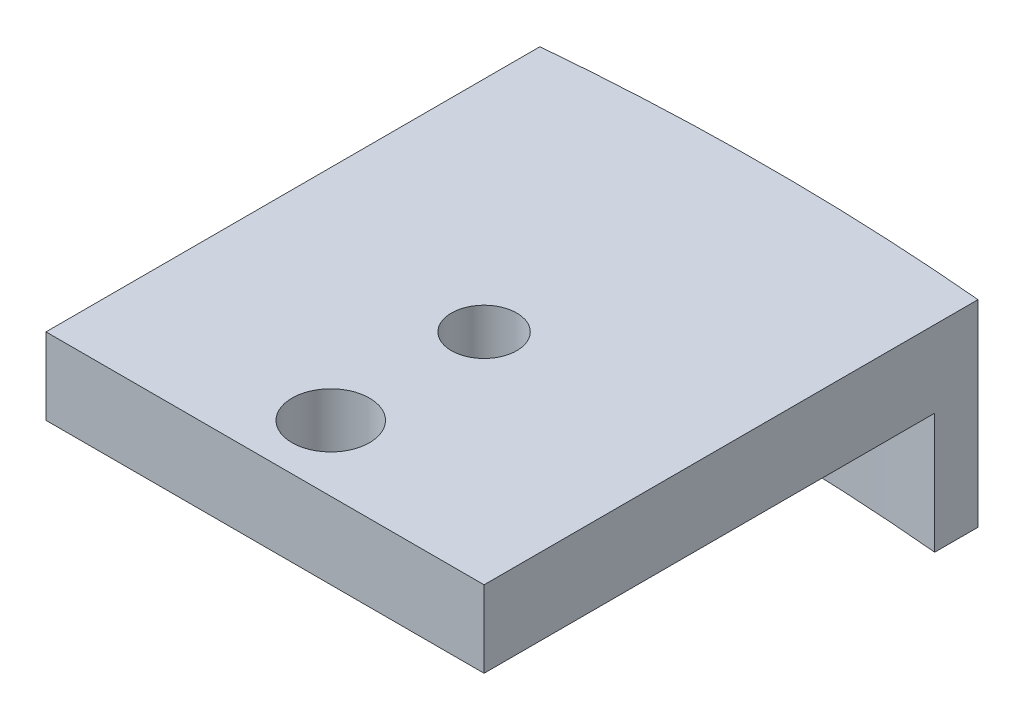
ISO-10303-21;
HEADER;
FILE_DESCRIPTION(('STEP AP214'),'2;1');
FILE_NAME('part.step','',(''),(''),'','','');
FILE_SCHEMA(('AUTOMOTIVE_DESIGN { 1 0 10303 214 1 1 1 1 }'));
ENDSEC;
DATA;
#1=APPLICATION_CONTEXT('core data for automotive mechanical design processes');
#2=APPLICATION_PROTOCOL_DEFINITION('international standard','automotive_design',2000,#1);
#3=PRODUCT_CONTEXT('',#1,'mechanical');
#4=PRODUCT('Part','Part','',(#3));
#5=PRODUCT_RELATED_PRODUCT_CATEGORY('part','',(#4));
#6=PRODUCT_DEFINITION_FORMATION('','',#4);
#7=PRODUCT_DEFINITION_CONTEXT('part definition',#1,'design');
#8=PRODUCT_DEFINITION('design','',#6,#7);
#9=PRODUCT_DEFINITION_SHAPE('','',#8);
#10=(LENGTH_UNIT() NAMED_UNIT(*) SI_UNIT(.MILLI.,.METRE.));
#11=(NAMED_UNIT(*) PLANE_ANGLE_UNIT() SI_UNIT($,.RADIAN.));
#12=(NAMED_UNIT(*) SI_UNIT($,.STERADIAN.) SOLID_ANGLE_UNIT());
#13=UNCERTAINTY_MEASURE_WITH_UNIT(LENGTH_MEASURE(1.E-05),#10,'distance_accuracy_value','');
#14=(GEOMETRIC_REPRESENTATION_CONTEXT(3) GLOBAL_UNCERTAINTY_ASSIGNED_CONTEXT((#13)) GLOBAL_UNIT_ASSIGNED_CONTEXT((#10,
#11,#12)) REPRESENTATION_CONTEXT('',''));
#15=CARTESIAN_POINT('',(0.,0.,0.));
#16=DIRECTION('',(0.,0.,1.));
#17=DIRECTION('',(1.,0.,0.));
#18=AXIS2_PLACEMENT_3D('',#15,#16,#17);
#19=CARTESIAN_POINT('',(0.,1219.2,0.));
#20=DIRECTION('',(0.,-1.,0.));
#21=DIRECTION('',(0.,0.,-1.));
#22=AXIS2_PLACEMENT_3D('',#19,#20,#21);
#23=CYLINDRICAL_SURFACE('',#22,176.2125);
#24=DIRECTION('',(0.,-1.,0.));
#25=VECTOR('',#24,1.);
#26=CARTESIAN_POINT('',(15.875,1219.2,-175.495953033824));
#27=LINE('',#26,#25);
#28=CARTESIAN_POINT('',(15.875,1219.2,-175.495953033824));
#29=VERTEX_POINT('',#28);
#30=CARTESIAN_POINT('',(15.875,1204.9125,-175.495953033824));
#31=VERTEX_POINT('',#30);
#32=EDGE_CURVE('E110',#29,#31,#27,.T.);
#33=ORIENTED_EDGE('',*,*,#32,.T.);
#34=CARTESIAN_POINT('',(0.,1204.9125,0.));
#35=DIRECTION('',(0.,1.,0.));
#36=DIRECTION('',(0.,0.,1.));
#37=AXIS2_PLACEMENT_3D('',#34,#35,#36);
#38=CIRCLE('',#37,176.2125);
#39=CARTESIAN_POINT('',(-15.875,1204.9125,-175.495953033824));
#40=VERTEX_POINT('',#39);
#41=EDGE_CURVE('E106',#31,#40,#38,.T.);
#42=ORIENTED_EDGE('',*,*,#41,.T.);
#43=DIRECTION('',(0.,-1.,0.));
#44=VECTOR('',#43,1.);
#45=CARTESIAN_POINT('',(-15.875,1219.2,-175.495953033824));
#46=LINE('',#45,#44);
#47=CARTESIAN_POINT('',(-15.875,1219.2,-175.495953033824));
#48=VERTEX_POINT('',#47);
#49=EDGE_CURVE('E11',#48,#40,#46,.T.);
#50=ORIENTED_EDGE('',*,*,#49,.F.);
#51=CARTESIAN_POINT('',(0.,1219.2,0.));
#52=DIRECTION('',(0.,1.,0.));
#53=DIRECTION('',(0.,0.,1.));
#54=AXIS2_PLACEMENT_3D('',#51,#52,#53);
#55=CIRCLE('',#54,176.2125);
#56=EDGE_CURVE('E125',#29,#48,#55,.T.);
#57=ORIENTED_EDGE('',*,*,#56,.F.);
#58=EDGE_LOOP('',(#33,#42,#50,#57));
#59=FACE_BOUND('',#58,.T.);
#60=ADVANCED_FACE('F32',(#59),#23,.T.);
#61=CARTESIAN_POINT('',(-15.875,1219.2,-175.495953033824));
#62=DIRECTION('',(1.,0.,0.));
#63=DIRECTION('',(0.,0.,-1.));
#64=AXIS2_PLACEMENT_3D('',#61,#62,#63);
#65=PLANE('',#64);
#66=ORIENTED_EDGE('',*,*,#49,.T.);
#67=DIRECTION('',(0.,0.,1.));
#68=VECTOR('',#67,1.);
#69=CARTESIAN_POINT('',(-15.875,1204.9125,-175.495953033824));
#70=LINE('',#69,#68);
#71=CARTESIAN_POINT('',(-15.875,1204.9125,-172.35876528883));
#72=VERTEX_POINT('',#71);
#73=EDGE_CURVE('E97',#40,#72,#70,.T.);
#74=ORIENTED_EDGE('',*,*,#73,.T.);
#75=DIRECTION('',(0.,1.,0.));
#76=VECTOR('',#75,1.);
#77=CARTESIAN_POINT('',(-15.875,1204.9125,-172.35876528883));
#78=LINE('',#77,#76);
#79=CARTESIAN_POINT('',(-15.875,1213.64375,-172.35876528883));
#80=VERTEX_POINT('',#79);
#81=EDGE_CURVE('E122',#72,#80,#78,.T.);
#82=ORIENTED_EDGE('',*,*,#81,.T.);
#83=DIRECTION('',(0.,0.,1.));
#84=VECTOR('',#83,1.);
#85=CARTESIAN_POINT('',(-15.875,1213.64375,-175.495953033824));
#86=LINE('',#85,#84);
#87=CARTESIAN_POINT('',(-15.875,1213.64375,-139.7));
#88=VERTEX_POINT('',#87);
#89=EDGE_CURVE('E129',#80,#88,#86,.T.);
#90=ORIENTED_EDGE('',*,*,#89,.T.);
#91=DIRECTION('',(0.,-1.,0.));
#92=VECTOR('',#91,1.);
#93=CARTESIAN_POINT('',(-15.875,1219.2,-139.7));
#94=LINE('',#93,#92);
#95=CARTESIAN_POINT('',(-15.875,1219.2,-139.7));
#96=VERTEX_POINT('',#95);
#97=EDGE_CURVE('E40',#96,#88,#94,.T.);
#98=ORIENTED_EDGE('',*,*,#97,.F.);
#99=DIRECTION('',(0.,0.,1.));
#100=VECTOR('',#99,1.);
#101=CARTESIAN_POINT('',(-15.875,1219.2,-175.495953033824));
#102=LINE('',#101,#100);
#103=EDGE_CURVE('E80',#48,#96,#102,.T.);
#104=ORIENTED_EDGE('',*,*,#103,.F.);
#105=EDGE_LOOP('',(#66,#74,#82,#90,#98,#104));
#106=FACE_BOUND('',#105,.T.);
#107=ADVANCED_FACE('F96',(#106),#65,.F.);
#108=CARTESIAN_POINT('',(-15.875,1219.2,-139.7));
#109=DIRECTION('',(0.,0.,-1.));
#110=DIRECTION('',(-1.,0.,0.));
#111=AXIS2_PLACEMENT_3D('',#108,#109,#110);
#112=PLANE('',#111);
#113=DIRECTION('',(1.,0.,0.));
#114=VECTOR('',#113,1.);
#115=CARTESIAN_POINT('',(-15.875,1213.64375,-139.7));
#116=LINE('',#115,#114);
#117=CARTESIAN_POINT('',(15.875,1213.64375,-139.7));
#118=VERTEX_POINT('',#117);
#119=EDGE_CURVE('E73',#88,#118,#116,.T.);
#120=ORIENTED_EDGE('',*,*,#119,.T.);
#121=DIRECTION('',(0.,-1.,0.));
#122=VECTOR('',#121,1.);
#123=CARTESIAN_POINT('',(15.875,1219.2,-139.7));
#124=LINE('',#123,#122);
#125=CARTESIAN_POINT('',(15.875,1219.2,-139.7));
#126=VERTEX_POINT('',#125);
#127=EDGE_CURVE('E170',#126,#118,#124,.T.);
#128=ORIENTED_EDGE('',*,*,#127,.F.);
#129=DIRECTION('',(1.,0.,0.));
#130=VECTOR('',#129,1.);
#131=CARTESIAN_POINT('',(-15.875,1219.2,-139.7));
#132=LINE('',#131,#130);
#133=EDGE_CURVE('E160',#96,#126,#132,.T.);
#134=ORIENTED_EDGE('',*,*,#133,.F.);
#135=ORIENTED_EDGE('',*,*,#97,.T.);
#136=EDGE_LOOP('',(#120,#128,#134,#135));
#137=FACE_BOUND('',#136,.T.);
#138=ADVANCED_FACE('F172',(#137),#112,.F.);
#139=CARTESIAN_POINT('',(15.875,1219.2,-175.495953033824));
#140=DIRECTION('',(-1.,0.,0.));
#141=DIRECTION('',(0.,0.,1.));
#142=AXIS2_PLACEMENT_3D('',#139,#140,#141);
#143=PLANE('',#142);
#144=DIRECTION('',(0.,0.,-1.));
#145=VECTOR('',#144,1.);
#146=CARTESIAN_POINT('',(15.875,1213.64375,-175.495953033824));
#147=LINE('',#146,#145);
#148=CARTESIAN_POINT('',(15.875,1213.64375,-172.35876528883));
#149=VERTEX_POINT('',#148);
#150=EDGE_CURVE('E159',#118,#149,#147,.T.);
#151=ORIENTED_EDGE('',*,*,#150,.T.);
#152=DIRECTION('',(0.,1.,0.));
#153=VECTOR('',#152,1.);
#154=CARTESIAN_POINT('',(15.875,1204.9125,-172.35876528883));
#155=LINE('',#154,#153);
#156=CARTESIAN_POINT('',(15.875,1204.9125,-172.35876528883));
#157=VERTEX_POINT('',#156);
#158=EDGE_CURVE('E48',#157,#149,#155,.T.);
#159=ORIENTED_EDGE('',*,*,#158,.F.);
#160=DIRECTION('',(0.,0.,-1.));
#161=VECTOR('',#160,1.);
#162=CARTESIAN_POINT('',(15.875,1204.9125,-172.35876528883));
#163=LINE('',#162,#161);
#164=EDGE_CURVE('E120',#157,#31,#163,.T.);
#165=ORIENTED_EDGE('',*,*,#164,.T.);
#166=ORIENTED_EDGE('',*,*,#32,.F.);
#167=DIRECTION('',(0.,0.,-1.));
#168=VECTOR('',#167,1.);
#169=CARTESIAN_POINT('',(15.875,1219.2,-175.495953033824));
#170=LINE('',#169,#168);
#171=EDGE_CURVE('E57',#126,#29,#170,.T.);
#172=ORIENTED_EDGE('',*,*,#171,.F.);
#173=ORIENTED_EDGE('',*,*,#127,.T.);
#174=EDGE_LOOP('',(#151,#159,#165,#166,#172,#173));
#175=FACE_BOUND('',#174,.T.);
#176=ADVANCED_FACE('F157',(#175),#143,.F.);
#177=CARTESIAN_POINT('',(0.,1219.2,0.));
#178=DIRECTION('',(0.,1.,0.));
#179=DIRECTION('',(0.,0.,1.));
#180=AXIS2_PLACEMENT_3D('',#177,#178,#179);
#181=PLANE('',#180);
#182=CARTESIAN_POINT('',(0.,1219.2,-144.4625));
#183=DIRECTION('',(0.,1.,0.));
#184=DIRECTION('',(0.,0.,1.));
#185=AXIS2_PLACEMENT_3D('',#182,#183,#184);
#186=CIRCLE('',#185,2.80670000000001);
#187=CARTESIAN_POINT('',(0.,1219.2,-141.6558));
#188=VERTEX_POINT('',#187);
#189=EDGE_CURVE('E144',#188,#188,#186,.T.);
#190=ORIENTED_EDGE('',*,*,#189,.F.);
#191=EDGE_LOOP('',(#190));
#192=FACE_BOUND('',#191,.T.);
#193=CARTESIAN_POINT('',(0.,1219.2,-155.575));
#194=DIRECTION('',(0.,1.,0.));
#195=DIRECTION('',(0.,0.,1.));
#196=AXIS2_PLACEMENT_3D('',#193,#194,#195);
#197=CIRCLE('',#196,2.36855000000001);
#198=CARTESIAN_POINT('',(0.,1219.2,-153.20645));
#199=VERTEX_POINT('',#198);
#200=EDGE_CURVE('E116',#199,#199,#197,.T.);
#201=ORIENTED_EDGE('',*,*,#200,.F.);
#202=EDGE_LOOP('',(#201));
#203=FACE_BOUND('',#202,.T.);
#204=ORIENTED_EDGE('',*,*,#56,.T.);
#205=ORIENTED_EDGE('',*,*,#103,.T.);
#206=ORIENTED_EDGE('',*,*,#133,.T.);
#207=ORIENTED_EDGE('',*,*,#171,.T.);
#208=EDGE_LOOP('',(#204,#205,#206,#207));
#209=FACE_BOUND('',#208,.T.);
#210=ADVANCED_FACE('F153',(#192,#203,#209),#181,.T.);
#211=CARTESIAN_POINT('',(0.,1213.64375,0.));
#212=DIRECTION('',(0.,1.,0.));
#213=DIRECTION('',(0.,0.,1.));
#214=AXIS2_PLACEMENT_3D('',#211,#212,#213);
#215=PLANE('',#214);
#216=CARTESIAN_POINT('',(0.,1213.64375,-144.4625));
#217=DIRECTION('',(0.,1.,0.));
#218=DIRECTION('',(0.,0.,1.));
#219=AXIS2_PLACEMENT_3D('',#216,#217,#218);
#220=CIRCLE('',#219,2.8067);
#221=CARTESIAN_POINT('',(0.,1213.64375,-141.6558));
#222=VERTEX_POINT('',#221);
#223=EDGE_CURVE('E35',#222,#222,#220,.T.);
#224=ORIENTED_EDGE('',*,*,#223,.T.);
#225=EDGE_LOOP('',(#224));
#226=FACE_BOUND('',#225,.T.);
#227=CARTESIAN_POINT('',(0.,1213.64375,-155.575));
#228=DIRECTION('',(0.,1.,0.));
#229=DIRECTION('',(0.,0.,1.));
#230=AXIS2_PLACEMENT_3D('',#227,#228,#229);
#231=CIRCLE('',#230,2.36855000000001);
#232=CARTESIAN_POINT('',(0.,1213.64375,-153.20645));
#233=VERTEX_POINT('',#232);
#234=EDGE_CURVE('E113',#233,#233,#231,.T.);
#235=ORIENTED_EDGE('',*,*,#234,.T.);
#236=EDGE_LOOP('',(#235));
#237=FACE_BOUND('',#236,.T.);
#238=ORIENTED_EDGE('',*,*,#89,.F.);
#239=CARTESIAN_POINT('',(0.,1213.64375,0.));
#240=DIRECTION('',(0.,-1.,0.));
#241=DIRECTION('',(0.,0.,1.));
#242=AXIS2_PLACEMENT_3D('',#239,#240,#241);
#243=CIRCLE('',#242,173.0883);
#244=EDGE_CURVE('E111',#80,#149,#243,.T.);
#245=ORIENTED_EDGE('',*,*,#244,.T.);
#246=ORIENTED_EDGE('',*,*,#150,.F.);
#247=ORIENTED_EDGE('',*,*,#119,.F.);
#248=EDGE_LOOP('',(#238,#245,#246,#247));
#249=FACE_BOUND('',#248,.T.);
#250=ADVANCED_FACE('F156',(#226,#237,#249),#215,.F.);
#251=CARTESIAN_POINT('',(0.,1204.9125,0.));
#252=DIRECTION('',(0.,1.,0.));
#253=DIRECTION('',(0.,0.,1.));
#254=AXIS2_PLACEMENT_3D('',#251,#252,#253);
#255=CYLINDRICAL_SURFACE('',#254,173.0883);
#256=ORIENTED_EDGE('',*,*,#244,.F.);
#257=ORIENTED_EDGE('',*,*,#81,.F.);
#258=CARTESIAN_POINT('',(0.,1204.9125,0.));
#259=DIRECTION('',(0.,-1.,0.));
#260=DIRECTION('',(0.,0.,1.));
#261=AXIS2_PLACEMENT_3D('',#258,#259,#260);
#262=CIRCLE('',#261,173.0883);
#263=EDGE_CURVE('E108',#72,#157,#262,.T.);
#264=ORIENTED_EDGE('',*,*,#263,.T.);
#265=ORIENTED_EDGE('',*,*,#158,.T.);
#266=EDGE_LOOP('',(#256,#257,#264,#265));
#267=FACE_BOUND('',#266,.T.);
#268=ADVANCED_FACE('F175',(#267),#255,.F.);
#269=CARTESIAN_POINT('',(0.,1204.9125,0.));
#270=DIRECTION('',(0.,1.,0.));
#271=DIRECTION('',(0.,0.,1.));
#272=AXIS2_PLACEMENT_3D('',#269,#270,#271);
#273=PLANE('',#272);
#274=ORIENTED_EDGE('',*,*,#41,.F.);
#275=ORIENTED_EDGE('',*,*,#164,.F.);
#276=ORIENTED_EDGE('',*,*,#263,.F.);
#277=ORIENTED_EDGE('',*,*,#73,.F.);
#278=EDGE_LOOP('',(#274,#275,#276,#277));
#279=FACE_BOUND('',#278,.T.);
#280=ADVANCED_FACE('F104',(#279),#273,.F.);
#281=CARTESIAN_POINT('',(0.,1219.2,-155.575));
#282=DIRECTION('',(0.,1.,0.));
#283=DIRECTION('',(0.,0.,1.));
#284=AXIS2_PLACEMENT_3D('',#281,#282,#283);
#285=CYLINDRICAL_SURFACE('',#284,2.36855000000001);
#286=ORIENTED_EDGE('',*,*,#200,.T.);
#287=EDGE_LOOP('',(#286));
#288=FACE_BOUND('',#287,.T.);
#289=ORIENTED_EDGE('',*,*,#234,.F.);
#290=EDGE_LOOP('',(#289));
#291=FACE_BOUND('',#290,.T.);
#292=ADVANCED_FACE('F237',(#288,#291),#285,.F.);
#293=CARTESIAN_POINT('',(0.,1219.2,-144.4625));
#294=DIRECTION('',(0.,1.,0.));
#295=DIRECTION('',(0.,0.,1.));
#296=AXIS2_PLACEMENT_3D('',#293,#294,#295);
#297=CYLINDRICAL_SURFACE('',#296,2.8067);
#298=ORIENTED_EDGE('',*,*,#189,.T.);
#299=EDGE_LOOP('',(#298));
#300=FACE_BOUND('',#299,.T.);
#301=ORIENTED_EDGE('',*,*,#223,.F.);
#302=EDGE_LOOP('',(#301));
#303=FACE_BOUND('',#302,.T.);
#304=ADVANCED_FACE('F150',(#300,#303),#297,.F.);
#305=CLOSED_SHELL('',(#60,#107,#138,#176,#210,#250,#268,#280,#292,#304));
#306=MANIFOLD_SOLID_BREP('B2',#305);
#307=ADVANCED_BREP_SHAPE_REPRESENTATION('',(#18,#306),#14);
#308=SHAPE_DEFINITION_REPRESENTATION(#9,#307);
ENDSEC;
END-ISO-10303-21;
